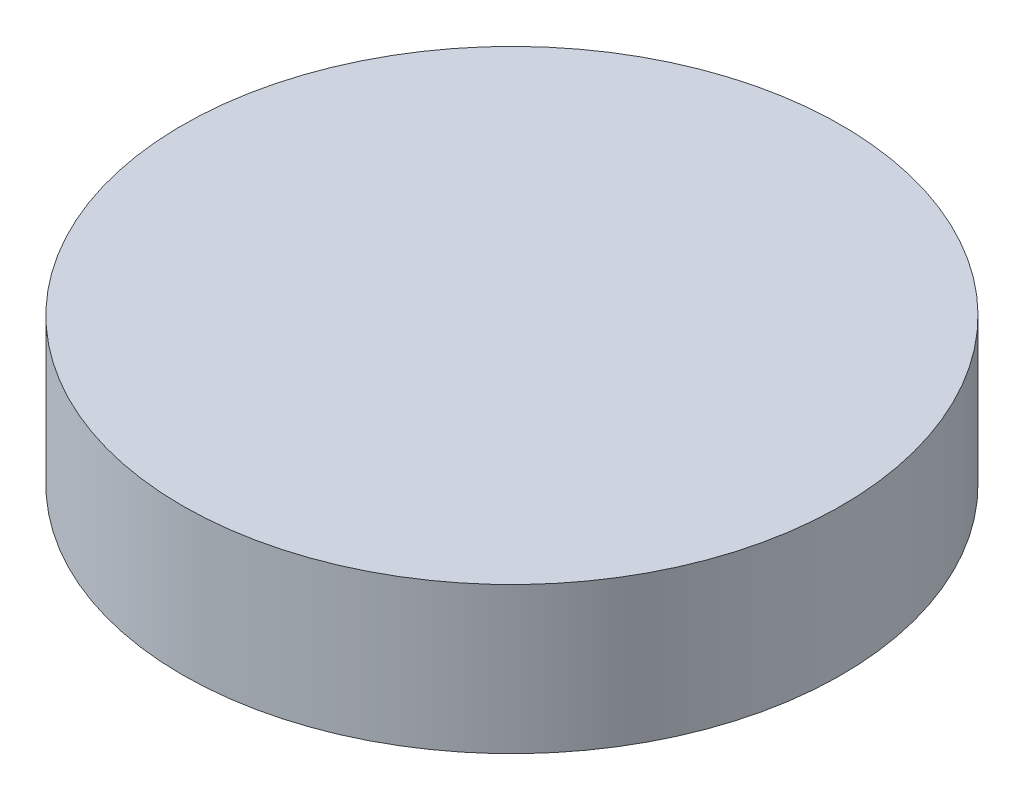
ISO-10303-21;
HEADER;
FILE_DESCRIPTION(('STEP AP214'),'2;1');
FILE_NAME('part.step','',(''),(''),'','','');
FILE_SCHEMA(('AUTOMOTIVE_DESIGN { 1 0 10303 214 1 1 1 1 }'));
ENDSEC;
DATA;
#1=APPLICATION_CONTEXT('core data for automotive mechanical design processes');
#2=APPLICATION_PROTOCOL_DEFINITION('international standard','automotive_design',2000,#1);
#3=PRODUCT_CONTEXT('',#1,'mechanical');
#4=PRODUCT('Part','Part','',(#3));
#5=PRODUCT_RELATED_PRODUCT_CATEGORY('part','',(#4));
#6=PRODUCT_DEFINITION_FORMATION('','',#4);
#7=PRODUCT_DEFINITION_CONTEXT('part definition',#1,'design');
#8=PRODUCT_DEFINITION('design','',#6,#7);
#9=PRODUCT_DEFINITION_SHAPE('','',#8);
#10=(LENGTH_UNIT() NAMED_UNIT(*) SI_UNIT(.MILLI.,.METRE.));
#11=(NAMED_UNIT(*) PLANE_ANGLE_UNIT() SI_UNIT($,.RADIAN.));
#12=(NAMED_UNIT(*) SI_UNIT($,.STERADIAN.) SOLID_ANGLE_UNIT());
#13=UNCERTAINTY_MEASURE_WITH_UNIT(LENGTH_MEASURE(1.E-05),#10,'distance_accuracy_value','');
#14=(GEOMETRIC_REPRESENTATION_CONTEXT(3) GLOBAL_UNCERTAINTY_ASSIGNED_CONTEXT((#13)) GLOBAL_UNIT_ASSIGNED_CONTEXT((#10,
#11,#12)) REPRESENTATION_CONTEXT('',''));
#15=CARTESIAN_POINT('',(0.,0.,0.));
#16=DIRECTION('',(0.,0.,1.));
#17=DIRECTION('',(1.,0.,0.));
#18=AXIS2_PLACEMENT_3D('',#15,#16,#17);
#19=CARTESIAN_POINT('',(0.,2.,0.));
#20=DIRECTION('',(0.,-1.,0.));
#21=DIRECTION('',(0.,0.,-1.));
#22=AXIS2_PLACEMENT_3D('',#19,#20,#21);
#23=CYLINDRICAL_SURFACE('',#22,4.5);
#24=CARTESIAN_POINT('',(0.,2.,0.));
#25=DIRECTION('',(0.,1.,0.));
#26=DIRECTION('',(0.,0.,1.));
#27=AXIS2_PLACEMENT_3D('',#24,#25,#26);
#28=CIRCLE('',#27,4.5);
#29=CARTESIAN_POINT('',(0.,2.,4.5));
#30=VERTEX_POINT('',#29);
#31=EDGE_CURVE('E10',#30,#30,#28,.T.);
#32=ORIENTED_EDGE('',*,*,#31,.F.);
#33=EDGE_LOOP('',(#32));
#34=FACE_BOUND('',#33,.T.);
#35=CARTESIAN_POINT('',(0.,0.,0.));
#36=DIRECTION('',(0.,1.,0.));
#37=DIRECTION('',(0.,0.,1.));
#38=AXIS2_PLACEMENT_3D('',#35,#36,#37);
#39=CIRCLE('',#38,4.5);
#40=CARTESIAN_POINT('',(0.,0.,4.5));
#41=VERTEX_POINT('',#40);
#42=EDGE_CURVE('E34',#41,#41,#39,.T.);
#43=ORIENTED_EDGE('',*,*,#42,.T.);
#44=EDGE_LOOP('',(#43));
#45=FACE_BOUND('',#44,.T.);
#46=ADVANCED_FACE('F31',(#34,#45),#23,.T.);
#47=CARTESIAN_POINT('',(0.,2.,0.));
#48=DIRECTION('',(0.,1.,0.));
#49=DIRECTION('',(0.,0.,1.));
#50=AXIS2_PLACEMENT_3D('',#47,#48,#49);
#51=PLANE('',#50);
#52=ORIENTED_EDGE('',*,*,#31,.T.);
#53=EDGE_LOOP('',(#52));
#54=FACE_BOUND('',#53,.T.);
#55=ADVANCED_FACE('F46',(#54),#51,.T.);
#56=CARTESIAN_POINT('',(0.,0.,0.));
#57=DIRECTION('',(0.,1.,0.));
#58=DIRECTION('',(0.,0.,1.));
#59=AXIS2_PLACEMENT_3D('',#56,#57,#58);
#60=PLANE('',#59);
#61=ORIENTED_EDGE('',*,*,#42,.F.);
#62=EDGE_LOOP('',(#61));
#63=FACE_BOUND('',#62,.T.);
#64=ADVANCED_FACE('F44',(#63),#60,.F.);
#65=CLOSED_SHELL('',(#46,#55,#64));
#66=MANIFOLD_SOLID_BREP('B2',#65);
#67=ADVANCED_BREP_SHAPE_REPRESENTATION('',(#18,#66),#14);
#68=SHAPE_DEFINITION_REPRESENTATION(#9,#67);
ENDSEC;
END-ISO-10303-21;
